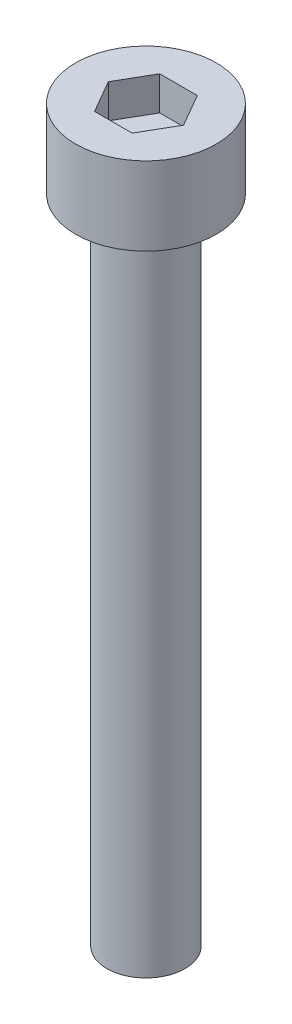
ISO-10303-21;
HEADER;
FILE_DESCRIPTION(('STEP AP214'),'2;1');
FILE_NAME('part.step','',(''),(''),'','','');
FILE_SCHEMA(('AUTOMOTIVE_DESIGN { 1 0 10303 214 1 1 1 1 }'));
ENDSEC;
DATA;
#1=APPLICATION_CONTEXT('core data for automotive mechanical design processes');
#2=APPLICATION_PROTOCOL_DEFINITION('international standard','automotive_design',2000,#1);
#3=PRODUCT_CONTEXT('',#1,'mechanical');
#4=PRODUCT('Part','Part','',(#3));
#5=PRODUCT_RELATED_PRODUCT_CATEGORY('part','',(#4));
#6=PRODUCT_DEFINITION_FORMATION('','',#4);
#7=PRODUCT_DEFINITION_CONTEXT('part definition',#1,'design');
#8=PRODUCT_DEFINITION('design','',#6,#7);
#9=PRODUCT_DEFINITION_SHAPE('','',#8);
#10=(LENGTH_UNIT() NAMED_UNIT(*) SI_UNIT(.MILLI.,.METRE.));
#11=(NAMED_UNIT(*) PLANE_ANGLE_UNIT() SI_UNIT($,.RADIAN.));
#12=(NAMED_UNIT(*) SI_UNIT($,.STERADIAN.) SOLID_ANGLE_UNIT());
#13=UNCERTAINTY_MEASURE_WITH_UNIT(LENGTH_MEASURE(1.E-05),#10,'distance_accuracy_value','');
#14=(GEOMETRIC_REPRESENTATION_CONTEXT(3) GLOBAL_UNCERTAINTY_ASSIGNED_CONTEXT((#13)) GLOBAL_UNIT_ASSIGNED_CONTEXT((#10,
#11,#12)) REPRESENTATION_CONTEXT('',''));
#15=CARTESIAN_POINT('',(0.,0.,0.));
#16=DIRECTION('',(0.,0.,1.));
#17=DIRECTION('',(1.,0.,0.));
#18=AXIS2_PLACEMENT_3D('',#15,#16,#17);
#19=CARTESIAN_POINT('',(0.,25.,0.));
#20=DIRECTION('',(0.,-1.,0.));
#21=DIRECTION('',(0.,0.,-1.));
#22=AXIS2_PLACEMENT_3D('',#19,#20,#21);
#23=CYLINDRICAL_SURFACE('',#22,1.5);
#24=CARTESIAN_POINT('',(0.,25.,0.));
#25=DIRECTION('',(0.,1.,0.));
#26=DIRECTION('',(0.,0.,1.));
#27=AXIS2_PLACEMENT_3D('',#24,#25,#26);
#28=CIRCLE('',#27,1.5);
#29=CARTESIAN_POINT('',(0.,25.,1.5));
#30=VERTEX_POINT('',#29);
#31=EDGE_CURVE('E11',#30,#30,#28,.T.);
#32=ORIENTED_EDGE('',*,*,#31,.F.);
#33=EDGE_LOOP('',(#32));
#34=FACE_BOUND('',#33,.T.);
#35=CARTESIAN_POINT('',(0.,0.,0.));
#36=DIRECTION('',(0.,1.,0.));
#37=DIRECTION('',(0.,0.,1.));
#38=AXIS2_PLACEMENT_3D('',#35,#36,#37);
#39=CIRCLE('',#38,1.5);
#40=CARTESIAN_POINT('',(0.,0.,1.5));
#41=VERTEX_POINT('',#40);
#42=EDGE_CURVE('E39',#41,#41,#39,.T.);
#43=ORIENTED_EDGE('',*,*,#42,.T.);
#44=EDGE_LOOP('',(#43));
#45=FACE_BOUND('',#44,.T.);
#46=ADVANCED_FACE('F36',(#34,#45),#23,.T.);
#47=CARTESIAN_POINT('',(0.,0.,0.));
#48=DIRECTION('',(0.,1.,0.));
#49=DIRECTION('',(0.,0.,1.));
#50=AXIS2_PLACEMENT_3D('',#47,#48,#49);
#51=PLANE('',#50);
#52=ORIENTED_EDGE('',*,*,#42,.F.);
#53=EDGE_LOOP('',(#52));
#54=FACE_BOUND('',#53,.T.);
#55=ADVANCED_FACE('F167',(#54),#51,.F.);
#56=CARTESIAN_POINT('',(0.,28.,0.));
#57=DIRECTION('',(0.,-1.,0.));
#58=DIRECTION('',(0.,0.,-1.));
#59=AXIS2_PLACEMENT_3D('',#56,#57,#58);
#60=CYLINDRICAL_SURFACE('',#59,2.7);
#61=CARTESIAN_POINT('',(0.,28.,0.));
#62=DIRECTION('',(0.,1.,0.));
#63=DIRECTION('',(0.,0.,1.));
#64=AXIS2_PLACEMENT_3D('',#61,#62,#63);
#65=CIRCLE('',#64,2.7);
#66=CARTESIAN_POINT('',(0.,28.,2.7));
#67=VERTEX_POINT('',#66);
#68=EDGE_CURVE('E143',#67,#67,#65,.T.);
#69=ORIENTED_EDGE('',*,*,#68,.F.);
#70=EDGE_LOOP('',(#69));
#71=FACE_BOUND('',#70,.T.);
#72=CARTESIAN_POINT('',(0.,25.,0.));
#73=DIRECTION('',(0.,1.,0.));
#74=DIRECTION('',(0.,0.,1.));
#75=AXIS2_PLACEMENT_3D('',#72,#73,#74);
#76=CIRCLE('',#75,2.7);
#77=CARTESIAN_POINT('',(0.,25.,2.7));
#78=VERTEX_POINT('',#77);
#79=EDGE_CURVE('E137',#78,#78,#76,.T.);
#80=ORIENTED_EDGE('',*,*,#79,.T.);
#81=EDGE_LOOP('',(#80));
#82=FACE_BOUND('',#81,.T.);
#83=ADVANCED_FACE('F149',(#71,#82),#60,.T.);
#84=CARTESIAN_POINT('',(0.,28.,0.));
#85=DIRECTION('',(0.,1.,0.));
#86=DIRECTION('',(0.,0.,1.));
#87=AXIS2_PLACEMENT_3D('',#84,#85,#86);
#88=PLANE('',#87);
#89=DIRECTION('',(0.5,0.,-0.866025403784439));
#90=VECTOR('',#89,1.);
#91=CARTESIAN_POINT('',(0.721687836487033,28.,1.25));
#92=LINE('',#91,#90);
#93=CARTESIAN_POINT('',(0.721687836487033,28.,1.25));
#94=VERTEX_POINT('',#93);
#95=CARTESIAN_POINT('',(1.44337567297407,28.,0.));
#96=VERTEX_POINT('',#95);
#97=EDGE_CURVE('E50',#94,#96,#92,.T.);
#98=ORIENTED_EDGE('',*,*,#97,.F.);
#99=DIRECTION('',(1.,0.,0.));
#100=VECTOR('',#99,1.);
#101=CARTESIAN_POINT('',(-0.721687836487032,28.,1.25));
#102=LINE('',#101,#100);
#103=CARTESIAN_POINT('',(-0.721687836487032,28.,1.25));
#104=VERTEX_POINT('',#103);
#105=EDGE_CURVE('E133',#104,#94,#102,.T.);
#106=ORIENTED_EDGE('',*,*,#105,.F.);
#107=DIRECTION('',(0.5,0.,0.866025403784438));
#108=VECTOR('',#107,1.);
#109=CARTESIAN_POINT('',(-1.44337567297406,28.,0.));
#110=LINE('',#109,#108);
#111=CARTESIAN_POINT('',(-1.44337567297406,28.,0.));
#112=VERTEX_POINT('',#111);
#113=EDGE_CURVE('E131',#112,#104,#110,.T.);
#114=ORIENTED_EDGE('',*,*,#113,.F.);
#115=DIRECTION('',(-0.5,0.,0.866025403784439));
#116=VECTOR('',#115,1.);
#117=CARTESIAN_POINT('',(-0.721687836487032,28.,-1.25));
#118=LINE('',#117,#116);
#119=CARTESIAN_POINT('',(-0.721687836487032,28.,-1.25));
#120=VERTEX_POINT('',#119);
#121=EDGE_CURVE('E98',#120,#112,#118,.T.);
#122=ORIENTED_EDGE('',*,*,#121,.F.);
#123=DIRECTION('',(-1.,0.,0.));
#124=VECTOR('',#123,1.);
#125=CARTESIAN_POINT('',(0.721687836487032,28.,-1.25));
#126=LINE('',#125,#124);
#127=CARTESIAN_POINT('',(0.721687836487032,28.,-1.25));
#128=VERTEX_POINT('',#127);
#129=EDGE_CURVE('E127',#128,#120,#126,.T.);
#130=ORIENTED_EDGE('',*,*,#129,.F.);
#131=DIRECTION('',(-0.5,0.,-0.866025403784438));
#132=VECTOR('',#131,1.);
#133=CARTESIAN_POINT('',(1.44337567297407,28.,0.));
#134=LINE('',#133,#132);
#135=EDGE_CURVE('E124',#96,#128,#134,.T.);
#136=ORIENTED_EDGE('',*,*,#135,.F.);
#137=EDGE_LOOP('',(#98,#106,#114,#122,#130,#136));
#138=FACE_BOUND('',#137,.T.);
#139=ORIENTED_EDGE('',*,*,#68,.T.);
#140=EDGE_LOOP('',(#139));
#141=FACE_BOUND('',#140,.T.);
#142=ADVANCED_FACE('F154',(#138,#141),#88,.T.);
#143=CARTESIAN_POINT('',(0.,25.,0.));
#144=DIRECTION('',(0.,1.,0.));
#145=DIRECTION('',(0.,0.,1.));
#146=AXIS2_PLACEMENT_3D('',#143,#144,#145);
#147=PLANE('',#146);
#148=ORIENTED_EDGE('',*,*,#31,.T.);
#149=EDGE_LOOP('',(#148));
#150=FACE_BOUND('',#149,.T.);
#151=ORIENTED_EDGE('',*,*,#79,.F.);
#152=EDGE_LOOP('',(#151));
#153=FACE_BOUND('',#152,.T.);
#154=ADVANCED_FACE('F151',(#150,#153),#147,.F.);
#155=CARTESIAN_POINT('',(0.721687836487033,26.7,1.25));
#156=DIRECTION('',(0.866025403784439,0.,0.5));
#157=DIRECTION('',(0.5,0.,-0.866025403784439));
#158=AXIS2_PLACEMENT_3D('',#155,#156,#157);
#159=PLANE('',#158);
#160=ORIENTED_EDGE('',*,*,#97,.T.);
#161=DIRECTION('',(0.,1.,0.));
#162=VECTOR('',#161,1.);
#163=CARTESIAN_POINT('',(1.44337567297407,26.7,0.));
#164=LINE('',#163,#162);
#165=CARTESIAN_POINT('',(1.44337567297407,26.7,0.));
#166=VERTEX_POINT('',#165);
#167=EDGE_CURVE('E80',#166,#96,#164,.T.);
#168=ORIENTED_EDGE('',*,*,#167,.F.);
#169=DIRECTION('',(0.5,0.,-0.866025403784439));
#170=VECTOR('',#169,1.);
#171=CARTESIAN_POINT('',(0.721687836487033,26.7,1.25));
#172=LINE('',#171,#170);
#173=CARTESIAN_POINT('',(0.721687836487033,26.7,1.25));
#174=VERTEX_POINT('',#173);
#175=EDGE_CURVE('E135',#174,#166,#172,.T.);
#176=ORIENTED_EDGE('',*,*,#175,.F.);
#177=DIRECTION('',(0.,1.,0.));
#178=VECTOR('',#177,1.);
#179=CARTESIAN_POINT('',(0.721687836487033,26.7,1.25));
#180=LINE('',#179,#178);
#181=EDGE_CURVE('E58',#174,#94,#180,.T.);
#182=ORIENTED_EDGE('',*,*,#181,.T.);
#183=EDGE_LOOP('',(#160,#168,#176,#182));
#184=FACE_BOUND('',#183,.T.);
#185=ADVANCED_FACE('F153',(#184),#159,.F.);
#186=CARTESIAN_POINT('',(-0.721687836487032,26.7,1.25));
#187=DIRECTION('',(0.,0.,1.));
#188=DIRECTION('',(1.,0.,0.));
#189=AXIS2_PLACEMENT_3D('',#186,#187,#188);
#190=PLANE('',#189);
#191=ORIENTED_EDGE('',*,*,#105,.T.);
#192=ORIENTED_EDGE('',*,*,#181,.F.);
#193=DIRECTION('',(1.,0.,0.));
#194=VECTOR('',#193,1.);
#195=CARTESIAN_POINT('',(-0.721687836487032,26.7,1.25));
#196=LINE('',#195,#194);
#197=CARTESIAN_POINT('',(-0.721687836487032,26.7,1.25));
#198=VERTEX_POINT('',#197);
#199=EDGE_CURVE('E110',#198,#174,#196,.T.);
#200=ORIENTED_EDGE('',*,*,#199,.F.);
#201=DIRECTION('',(0.,1.,0.));
#202=VECTOR('',#201,1.);
#203=CARTESIAN_POINT('',(-0.721687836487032,26.7,1.25));
#204=LINE('',#203,#202);
#205=EDGE_CURVE('E102',#198,#104,#204,.T.);
#206=ORIENTED_EDGE('',*,*,#205,.T.);
#207=EDGE_LOOP('',(#191,#192,#200,#206));
#208=FACE_BOUND('',#207,.T.);
#209=ADVANCED_FACE('F161',(#208),#190,.F.);
#210=CARTESIAN_POINT('',(-1.44337567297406,26.7,0.));
#211=DIRECTION('',(-0.866025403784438,0.,0.5));
#212=DIRECTION('',(0.5,0.,0.866025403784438));
#213=AXIS2_PLACEMENT_3D('',#210,#211,#212);
#214=PLANE('',#213);
#215=ORIENTED_EDGE('',*,*,#113,.T.);
#216=ORIENTED_EDGE('',*,*,#205,.F.);
#217=DIRECTION('',(0.5,0.,0.866025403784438));
#218=VECTOR('',#217,1.);
#219=CARTESIAN_POINT('',(-1.44337567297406,26.7,0.));
#220=LINE('',#219,#218);
#221=CARTESIAN_POINT('',(-1.44337567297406,26.7,0.));
#222=VERTEX_POINT('',#221);
#223=EDGE_CURVE('E106',#222,#198,#220,.T.);
#224=ORIENTED_EDGE('',*,*,#223,.F.);
#225=DIRECTION('',(0.,1.,0.));
#226=VECTOR('',#225,1.);
#227=CARTESIAN_POINT('',(-1.44337567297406,26.7,0.));
#228=LINE('',#227,#226);
#229=EDGE_CURVE('E91',#222,#112,#228,.T.);
#230=ORIENTED_EDGE('',*,*,#229,.T.);
#231=EDGE_LOOP('',(#215,#216,#224,#230));
#232=FACE_BOUND('',#231,.T.);
#233=ADVANCED_FACE('F107',(#232),#214,.F.);
#234=CARTESIAN_POINT('',(-0.721687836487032,26.7,-1.25));
#235=DIRECTION('',(-0.866025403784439,0.,-0.5));
#236=DIRECTION('',(-0.5,0.,0.866025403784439));
#237=AXIS2_PLACEMENT_3D('',#234,#235,#236);
#238=PLANE('',#237);
#239=ORIENTED_EDGE('',*,*,#121,.T.);
#240=ORIENTED_EDGE('',*,*,#229,.F.);
#241=DIRECTION('',(-0.5,0.,0.866025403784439));
#242=VECTOR('',#241,1.);
#243=CARTESIAN_POINT('',(-0.721687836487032,26.7,-1.25));
#244=LINE('',#243,#242);
#245=CARTESIAN_POINT('',(-0.721687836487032,26.7,-1.25));
#246=VERTEX_POINT('',#245);
#247=EDGE_CURVE('E95',#246,#222,#244,.T.);
#248=ORIENTED_EDGE('',*,*,#247,.F.);
#249=DIRECTION('',(0.,1.,0.));
#250=VECTOR('',#249,1.);
#251=CARTESIAN_POINT('',(-0.721687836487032,26.7,-1.25));
#252=LINE('',#251,#250);
#253=EDGE_CURVE('E103',#246,#120,#252,.T.);
#254=ORIENTED_EDGE('',*,*,#253,.T.);
#255=EDGE_LOOP('',(#239,#240,#248,#254));
#256=FACE_BOUND('',#255,.T.);
#257=ADVANCED_FACE('F93',(#256),#238,.F.);
#258=CARTESIAN_POINT('',(0.721687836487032,26.7,-1.25));
#259=DIRECTION('',(0.,0.,-1.));
#260=DIRECTION('',(-1.,0.,0.));
#261=AXIS2_PLACEMENT_3D('',#258,#259,#260);
#262=PLANE('',#261);
#263=ORIENTED_EDGE('',*,*,#129,.T.);
#264=ORIENTED_EDGE('',*,*,#253,.F.);
#265=DIRECTION('',(-1.,0.,0.));
#266=VECTOR('',#265,1.);
#267=CARTESIAN_POINT('',(0.721687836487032,26.7,-1.25));
#268=LINE('',#267,#266);
#269=CARTESIAN_POINT('',(0.721687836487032,26.7,-1.25));
#270=VERTEX_POINT('',#269);
#271=EDGE_CURVE('E116',#270,#246,#268,.T.);
#272=ORIENTED_EDGE('',*,*,#271,.F.);
#273=DIRECTION('',(0.,1.,0.));
#274=VECTOR('',#273,1.);
#275=CARTESIAN_POINT('',(0.721687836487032,26.7,-1.25));
#276=LINE('',#275,#274);
#277=EDGE_CURVE('E140',#270,#128,#276,.T.);
#278=ORIENTED_EDGE('',*,*,#277,.T.);
#279=EDGE_LOOP('',(#263,#264,#272,#278));
#280=FACE_BOUND('',#279,.T.);
#281=ADVANCED_FACE('F222',(#280),#262,.F.);
#282=CARTESIAN_POINT('',(1.44337567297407,26.7,0.));
#283=DIRECTION('',(0.866025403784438,0.,-0.5));
#284=DIRECTION('',(-0.5,0.,-0.866025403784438));
#285=AXIS2_PLACEMENT_3D('',#282,#283,#284);
#286=PLANE('',#285);
#287=ORIENTED_EDGE('',*,*,#135,.T.);
#288=ORIENTED_EDGE('',*,*,#277,.F.);
#289=DIRECTION('',(-0.5,0.,-0.866025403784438));
#290=VECTOR('',#289,1.);
#291=CARTESIAN_POINT('',(1.44337567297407,26.7,0.));
#292=LINE('',#291,#290);
#293=EDGE_CURVE('E118',#166,#270,#292,.T.);
#294=ORIENTED_EDGE('',*,*,#293,.F.);
#295=ORIENTED_EDGE('',*,*,#167,.T.);
#296=EDGE_LOOP('',(#287,#288,#294,#295));
#297=FACE_BOUND('',#296,.T.);
#298=ADVANCED_FACE('F231',(#297),#286,.F.);
#299=CARTESIAN_POINT('',(0.,26.7,0.));
#300=DIRECTION('',(0.,1.,0.));
#301=DIRECTION('',(0.,0.,1.));
#302=AXIS2_PLACEMENT_3D('',#299,#300,#301);
#303=PLANE('',#302);
#304=ORIENTED_EDGE('',*,*,#175,.T.);
#305=ORIENTED_EDGE('',*,*,#293,.T.);
#306=ORIENTED_EDGE('',*,*,#271,.T.);
#307=ORIENTED_EDGE('',*,*,#247,.T.);
#308=ORIENTED_EDGE('',*,*,#223,.T.);
#309=ORIENTED_EDGE('',*,*,#199,.T.);
#310=EDGE_LOOP('',(#304,#305,#306,#307,#308,#309));
#311=FACE_BOUND('',#310,.T.);
#312=ADVANCED_FACE('F113',(#311),#303,.T.);
#313=CLOSED_SHELL('',(#46,#55,#83,#142,#154,#185,#209,#233,#257,#281,#298,#312));
#314=MANIFOLD_SOLID_BREP('B2',#313);
#315=ADVANCED_BREP_SHAPE_REPRESENTATION('',(#18,#314),#14);
#316=SHAPE_DEFINITION_REPRESENTATION(#9,#315);
ENDSEC;
END-ISO-10303-21;
